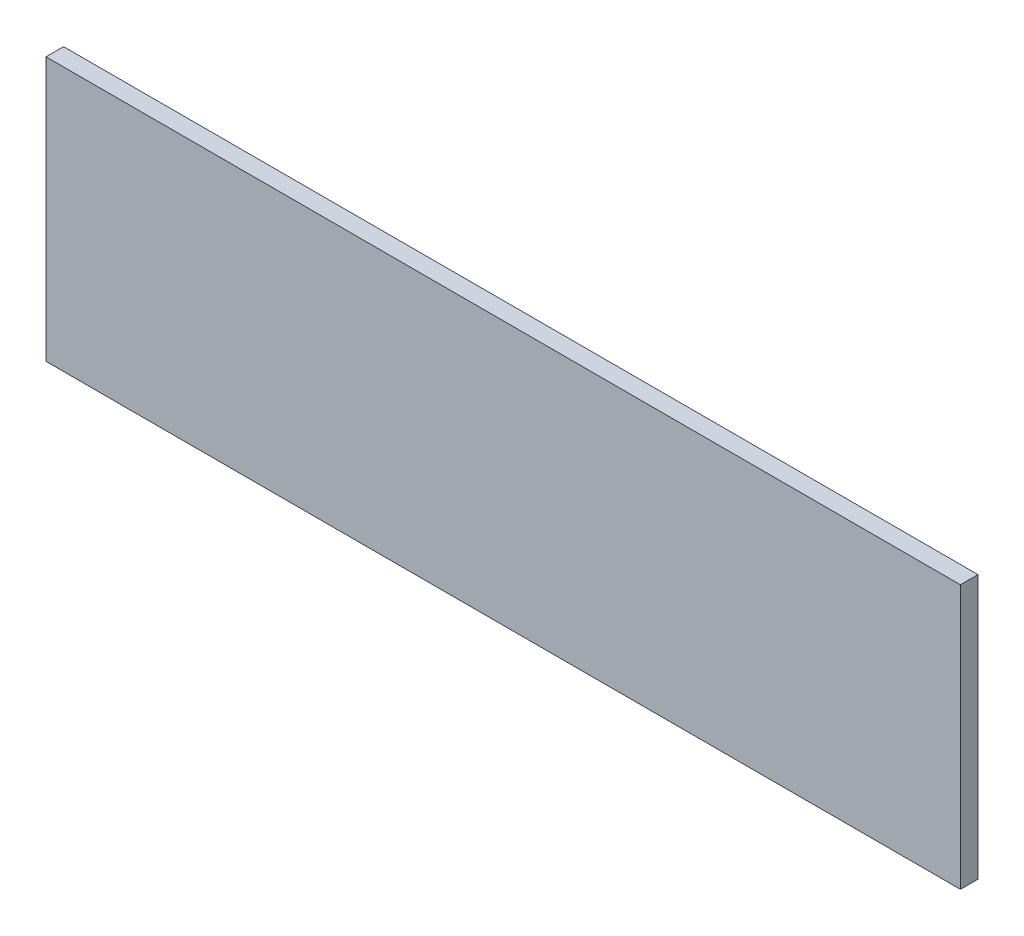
from build123d import *

# Parameters (mm, degrees)
SKETCH1_W           = 82.55
SKETCH1_H           = 23.8125
BOSS_EXTRUDE1_DEPTH = 1.5875


with BuildPart() as part:
    # Sketch1 → Boss-Extrude1 (new body)
    with BuildSketch(Plane.XY):
        with Locations((41.275, 11.90625)):
            Rectangle(SKETCH1_W, SKETCH1_H)
    extrude(amount=BOSS_EXTRUDE1_DEPTH)


solid = part.part
